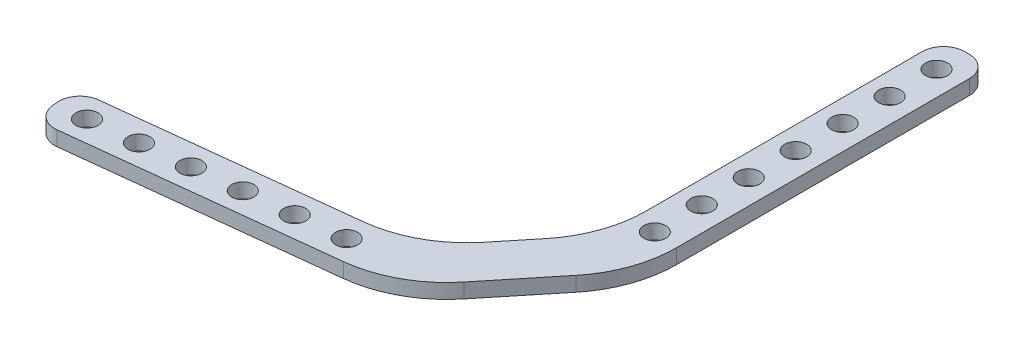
from build123d import *

# Parameters (mm, degrees)
SKETCH1_R           = 2.38125
BOSS_EXTRUDE1_DEPTH = 3.175
FILLET1_R           = 25.4


with BuildPart() as part:
    # Sketch1 → Boss-Extrude1 (new body)
    with BuildSketch(Plane(origin=(0, 0, 0), x_dir=(1, 0, 0), z_dir=(0, 1, 0))):
        with BuildLine():
            Line((0, 0), (0, 72.37519815))
            ThreePointArc((0, 72.37519815), (-1.339107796, 75.608090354), (-4.572, 76.94719815))
            Line((-4.572, 76.94719815), (-5.588, 76.94719815))
            ThreePointArc((-5.588, 76.94719815), (-8.820892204, 75.608090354), (-10.16, 72.37519815))
            Line((-10.16, 72.37519815), (-10.16, 3.607212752))
            Line((-10.16, 3.607212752), (-28.380428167, -18.817929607))
            Line((-28.380428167, -18.817929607), (-90.218162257, -25.797860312))
            ThreePointArc((-90.218162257, -25.797860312), (-93.280456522, -27.491128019), (-94.248504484, -30.853818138))
            Line((-94.248504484, -30.853818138), (-94.134547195, -31.863407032))
            ThreePointArc((-94.134547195, -31.863407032), (-92.441279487, -34.925701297), (-89.078589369, -35.893749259))
            Line((-89.078589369, -35.893749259), (-23.114, -28.448))
            Line((-23.114, -28.448), (0, 0))
        make_face()
        with Locations(Location((-87.881595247, -30.64637953, 0), (0, 0, 270))):
            Circle(SKETCH1_R, mode=Mode.SUBTRACT)
        with Locations(Location((-77.7857063, -29.506806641, 0), (0, 0, 270))):
            Circle(SKETCH1_R, mode=Mode.SUBTRACT)
        with Locations(Location((-67.689817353, -28.367233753, 0), (0, 0, 270))):
            Circle(SKETCH1_R, mode=Mode.SUBTRACT)
        with Locations(Location((-57.593928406, -27.227660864, 0), (0, 0, 270))):
            Circle(SKETCH1_R, mode=Mode.SUBTRACT)
        with Locations(Location((-47.498039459, -26.088087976, 0), (0, 0, 270))):
            Circle(SKETCH1_R, mode=Mode.SUBTRACT)
        with Locations(Location((-5.310349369, 70.59719815, 0), (0, 0, 270))):
            Circle(SKETCH1_R, mode=Mode.SUBTRACT)
        with Locations(Location((-5.310349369, 60.43719815, 0), (0, 0, 270))):
            Circle(SKETCH1_R, mode=Mode.SUBTRACT)
        with Locations(Location((-5.310349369, 50.27719815, 0), (0, 0, 270))):
            Circle(SKETCH1_R, mode=Mode.SUBTRACT)
        with Locations(Location((-5.310349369, 40.11719815, 0), (0, 0, 270))):
            Circle(SKETCH1_R, mode=Mode.SUBTRACT)
        with Locations(Location((-5.310349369, 29.95719815, 0), (0, 0, 270))):
            Circle(SKETCH1_R, mode=Mode.SUBTRACT)
        with Locations(Location((-5.310349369, 19.79719815, 0), (0, 0, 270))):
            Circle(SKETCH1_R, mode=Mode.SUBTRACT)
        with Locations(Location((-37.402150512, -24.948515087, 0), (0, 0, 270))):
            Circle(SKETCH1_R, mode=Mode.SUBTRACT)
        with Locations(Location((-5.310349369, 9.63719815, 0), (0, 0, 270))):
            Circle(SKETCH1_R, mode=Mode.SUBTRACT)
    extrude(amount=BOSS_EXTRUDE1_DEPTH)

    # Fillet1
    fillet1_edges = [part.edges().sort_by_distance(p)[0] for p in [
        (-23.114, 1.5875, 28.448),
        (-28.380428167, 1.5875, 18.817929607),
        (-10.16, 1.5875, -3.607212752),
        (0, 1.5875, 0),
    ]]
    fillet(fillet1_edges, radius=FILLET1_R)


solid = part.part
